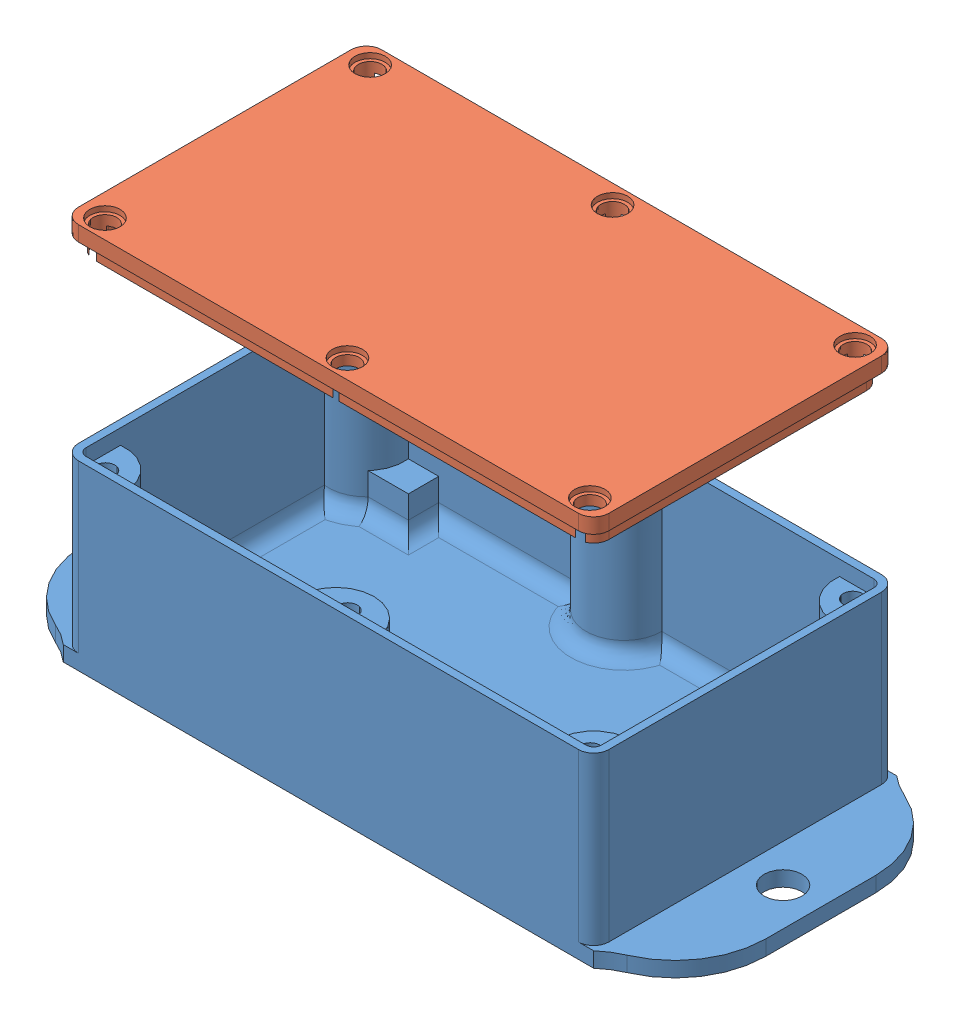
SolidWorks assembly PCB ENCLOSER ASSEMBLY.SLDASM, configuration Default (file format 9000). Lengths in mm.
Overall size (90 51 40).
2 component instances, 2 part files, 3 mates.
Components (placement in the parent):
- 1.PCB BOX-1: 1.PCB BOX.SLDPRT [Default] at (-25.7162 0 27.3565) size (90 24 40)
- 2.PCB COVER-3: 2.PCB COVER.SLDPRT [Default] at (-25.7162 49 27.3565) size (70 4 40)
Mates (geometry in assembly coordinates):
- Coincident1: coincident aligned: plane of 1.PCB BOX-1 through (-60.7162 2 47.3565) normal (0 0 1); plane of 2.PCB COVER-3 through (-58.7162 51 47.3565) normal (0 0 1)
- Coincident2: coincident aligned: plane of 1.PCB BOX-1 through (9.2838 22 9.3565) normal (1 0 0); plane of 2.PCB COVER-3 through (9.2838 51 45.3565) normal (1 0 0)
- LimitDistance1: limit distance = 25 mm anti-aligned: plane of 1.PCB BOX-1 through (-58.7162 24 45.3565) normal (0 1 0); plane of 2.PCB COVER-3 through (-58.7162 49 45.3565) normal (0 -1 0)
